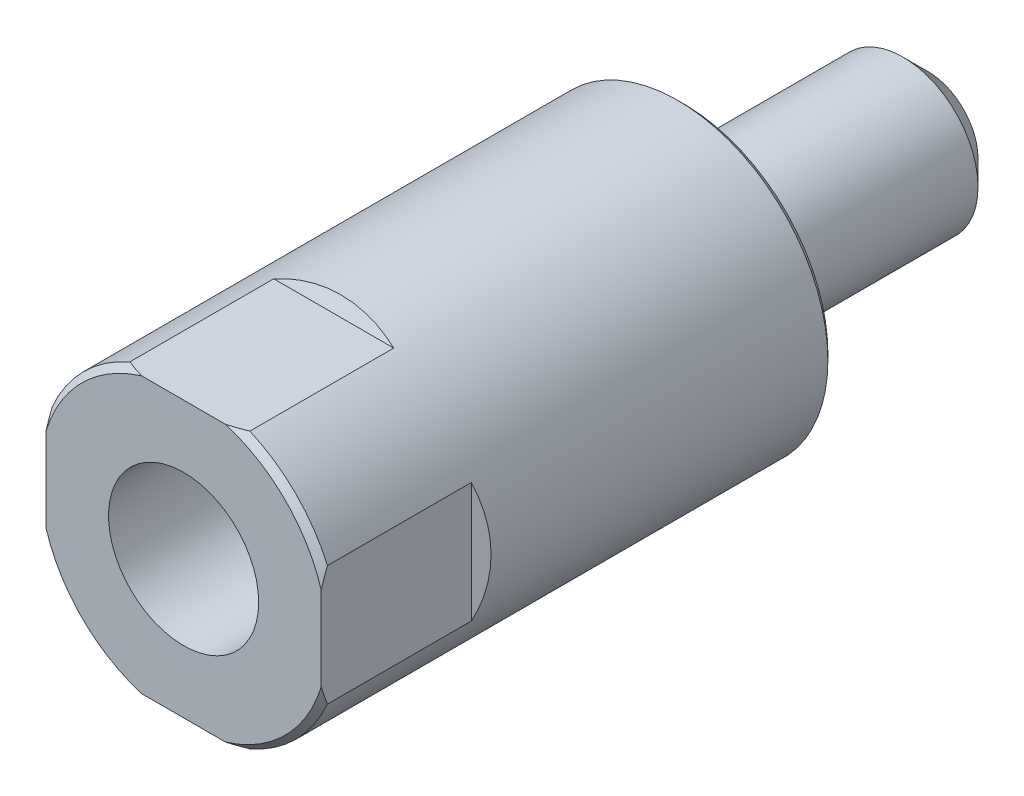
ISO-10303-21;
HEADER;
FILE_DESCRIPTION(('STEP AP214'),'2;1');
FILE_NAME('part.step','',(''),(''),'','','');
FILE_SCHEMA(('AUTOMOTIVE_DESIGN { 1 0 10303 214 1 1 1 1 }'));
ENDSEC;
DATA;
#1=APPLICATION_CONTEXT('core data for automotive mechanical design processes');
#2=APPLICATION_PROTOCOL_DEFINITION('international standard','automotive_design',2000,#1);
#3=PRODUCT_CONTEXT('',#1,'mechanical');
#4=PRODUCT('Part','Part','',(#3));
#5=PRODUCT_RELATED_PRODUCT_CATEGORY('part','',(#4));
#6=PRODUCT_DEFINITION_FORMATION('','',#4);
#7=PRODUCT_DEFINITION_CONTEXT('part definition',#1,'design');
#8=PRODUCT_DEFINITION('design','',#6,#7);
#9=PRODUCT_DEFINITION_SHAPE('','',#8);
#10=(LENGTH_UNIT() NAMED_UNIT(*) SI_UNIT(.MILLI.,.METRE.));
#11=(NAMED_UNIT(*) PLANE_ANGLE_UNIT() SI_UNIT($,.RADIAN.));
#12=(NAMED_UNIT(*) SI_UNIT($,.STERADIAN.) SOLID_ANGLE_UNIT());
#13=UNCERTAINTY_MEASURE_WITH_UNIT(LENGTH_MEASURE(1.E-05),#10,'distance_accuracy_value','');
#14=(GEOMETRIC_REPRESENTATION_CONTEXT(3) GLOBAL_UNCERTAINTY_ASSIGNED_CONTEXT((#13)) GLOBAL_UNIT_ASSIGNED_CONTEXT((#10,
#11,#12)) REPRESENTATION_CONTEXT('',''));
#15=CARTESIAN_POINT('',(0.,0.,0.));
#16=DIRECTION('',(0.,0.,1.));
#17=DIRECTION('',(1.,0.,0.));
#18=AXIS2_PLACEMENT_3D('',#15,#16,#17);
#19=CARTESIAN_POINT('',(0.,0.,-19.5));
#20=DIRECTION('',(0.,0.,1.));
#21=DIRECTION('',(1.,0.,0.));
#22=AXIS2_PLACEMENT_3D('',#19,#20,#21);
#23=PLANE('',#22);
#24=CARTESIAN_POINT('',(0.,0.,-19.5));
#25=DIRECTION('',(0.,0.,1.));
#26=DIRECTION('',(1.,0.,0.));
#27=AXIS2_PLACEMENT_3D('',#24,#25,#26);
#28=CIRCLE('',#27,4.);
#29=CARTESIAN_POINT('',(4.,0.,-19.5));
#30=VERTEX_POINT('',#29);
#31=EDGE_CURVE('E139',#30,#30,#28,.F.);
#32=ORIENTED_EDGE('',*,*,#31,.T.);
#33=EDGE_LOOP('',(#32));
#34=FACE_BOUND('',#33,.T.);
#35=ADVANCED_FACE('F14',(#34),#23,.F.);
#36=CARTESIAN_POINT('',(0.,0.,0.5));
#37=DIRECTION('',(0.,0.,1.));
#38=DIRECTION('',(1.,0.,0.));
#39=AXIS2_PLACEMENT_3D('',#36,#37,#38);
#40=CYLINDRICAL_SURFACE('',#39,6.);
#41=CARTESIAN_POINT('',(0.,0.,-17.5));
#42=DIRECTION('',(0.,0.,1.));
#43=DIRECTION('',(1.,0.,0.));
#44=AXIS2_PLACEMENT_3D('',#41,#42,#43);
#45=CIRCLE('',#44,6.);
#46=CARTESIAN_POINT('',(6.,0.,-17.5));
#47=VERTEX_POINT('',#46);
#48=EDGE_CURVE('E176',#47,#47,#45,.T.);
#49=ORIENTED_EDGE('',*,*,#48,.T.);
#50=EDGE_LOOP('',(#49));
#51=FACE_BOUND('',#50,.T.);
#52=CARTESIAN_POINT('',(0.,1.32706345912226E-13,0.));
#53=DIRECTION('',(0.,0.,1.));
#54=DIRECTION('',(1.,0.,0.));
#55=AXIS2_PLACEMENT_3D('',#52,#53,#54);
#56=CIRCLE('',#55,6.);
#57=CARTESIAN_POINT('',(6.,1.32706345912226E-13,0.));
#58=VERTEX_POINT('',#57);
#59=EDGE_CURVE('E136',#58,#58,#56,.T.);
#60=ORIENTED_EDGE('',*,*,#59,.F.);
#61=EDGE_LOOP('',(#60));
#62=FACE_BOUND('',#61,.T.);
#63=ADVANCED_FACE('F239',(#51,#62),#40,.T.);
#64=CARTESIAN_POINT('',(6.,0.,10.5));
#65=DIRECTION('',(0.,0.,-1.));
#66=DIRECTION('',(-1.,0.,0.));
#67=AXIS2_PLACEMENT_3D('',#64,#65,#66);
#68=PLANE('',#67);
#69=CARTESIAN_POINT('',(0.,0.,10.5));
#70=DIRECTION('',(0.,0.,1.));
#71=DIRECTION('',(1.,0.,0.));
#72=AXIS2_PLACEMENT_3D('',#69,#70,#71);
#73=CIRCLE('',#72,6.);
#74=CARTESIAN_POINT('',(6.,0.,10.5));
#75=VERTEX_POINT('',#74);
#76=EDGE_CURVE('E122',#75,#75,#73,.T.);
#77=ORIENTED_EDGE('',*,*,#76,.T.);
#78=EDGE_LOOP('',(#77));
#79=FACE_BOUND('',#78,.T.);
#80=ADVANCED_FACE('F223',(#79),#68,.F.);
#81=CARTESIAN_POINT('',(11.,-12.,28.));
#82=DIRECTION('',(-0.5,0.,-0.866025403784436));
#83=DIRECTION('',(-0.866025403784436,0.,0.5));
#84=AXIS2_PLACEMENT_3D('',#81,#82,#83);
#85=PLANE('',#84);
#86=CARTESIAN_POINT('',(0.,0.,34.3508529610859));
#87=DIRECTION('',(-0.5,0.,-0.866025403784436));
#88=DIRECTION('',(0.866025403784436,0.,-0.5));
#89=AXIS2_PLACEMENT_3D('',#86,#87,#88);
#90=ELLIPSE('',#89,13.8564064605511,12.);
#91=CARTESIAN_POINT('',(11.,4.7958315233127,28.));
#92=VERTEX_POINT('',#91);
#93=CARTESIAN_POINT('',(11.,-4.79583152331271,28.));
#94=VERTEX_POINT('',#93);
#95=EDGE_CURVE('E159',#92,#94,#90,.T.);
#96=ORIENTED_EDGE('',*,*,#95,.F.);
#97=DIRECTION('',(0.,1.,0.));
#98=VECTOR('',#97,1.);
#99=CARTESIAN_POINT('',(11.,-12.,28.));
#100=LINE('',#99,#98);
#101=EDGE_CURVE('E149',#94,#92,#100,.T.);
#102=ORIENTED_EDGE('',*,*,#101,.F.);
#103=EDGE_LOOP('',(#96,#102));
#104=FACE_BOUND('',#103,.T.);
#105=ADVANCED_FACE('F214',(#104),#85,.F.);
#106=CARTESIAN_POINT('',(11.,-12.,40.));
#107=DIRECTION('',(-1.,0.,0.));
#108=DIRECTION('',(0.,0.,1.));
#109=AXIS2_PLACEMENT_3D('',#106,#107,#108);
#110=PLANE('',#109);
#111=DIRECTION('',(0.,-1.,0.));
#112=VECTOR('',#111,1.);
#113=CARTESIAN_POINT('',(11.,0.,40.));
#114=LINE('',#113,#112);
#115=CARTESIAN_POINT('',(11.,3.35410196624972,40.));
#116=VERTEX_POINT('',#115);
#117=CARTESIAN_POINT('',(11.,-3.3541019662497,40.));
#118=VERTEX_POINT('',#117);
#119=EDGE_CURVE('E156',#116,#118,#114,.T.);
#120=ORIENTED_EDGE('',*,*,#119,.T.);
#121=CARTESIAN_POINT('',(11.,-3.3541019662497,40.));
#122=CARTESIAN_POINT('',(11.,-3.47626806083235,39.9643692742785));
#123=CARTESIAN_POINT('',(11.,-3.59795060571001,39.9270977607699));
#124=CARTESIAN_POINT('',(11.,-3.84025690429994,39.8494888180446));
#125=CARTESIAN_POINT('',(11.,-3.96088123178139,39.8091531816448));
#126=CARTESIAN_POINT('',(11.,-4.2011163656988,39.7255915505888));
#127=CARTESIAN_POINT('',(11.,-4.32072721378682,39.6823656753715));
#128=CARTESIAN_POINT('',(11.,-4.55900582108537,39.5931815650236));
#129=CARTESIAN_POINT('',(11.,-4.67767299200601,39.5472217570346));
#130=CARTESIAN_POINT('',(11.,-4.79583152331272,39.5));
#131=B_SPLINE_CURVE_WITH_KNOTS('',3,(#121,#122,#123,#124,#125,#126,#127,#128,#129,#130),
.UNSPECIFIED.,.F.,.F.,(4,2,2,2,4),(0.,0.381749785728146,0.763277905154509,1.14479026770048,
1.52652428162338),.UNSPECIFIED.);
#132=CARTESIAN_POINT('',(11.,-4.79583152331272,39.5));
#133=VERTEX_POINT('',#132);
#134=EDGE_CURVE('E198',#118,#133,#131,.T.);
#135=ORIENTED_EDGE('',*,*,#134,.T.);
#136=DIRECTION('',(0.,0.,-1.));
#137=VECTOR('',#136,1.);
#138=CARTESIAN_POINT('',(11.,-4.79583152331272,40.));
#139=LINE('',#138,#137);
#140=EDGE_CURVE('E152',#94,#133,#139,.F.);
#141=ORIENTED_EDGE('',*,*,#140,.F.);
#142=ORIENTED_EDGE('',*,*,#101,.T.);
#143=DIRECTION('',(0.,0.,-1.));
#144=VECTOR('',#143,1.);
#145=CARTESIAN_POINT('',(11.,4.79583152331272,40.));
#146=LINE('',#145,#144);
#147=CARTESIAN_POINT('',(11.,4.79583152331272,39.5));
#148=VERTEX_POINT('',#147);
#149=EDGE_CURVE('E154',#148,#92,#146,.T.);
#150=ORIENTED_EDGE('',*,*,#149,.F.);
#151=CARTESIAN_POINT('',(11.,4.79583152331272,39.5));
#152=CARTESIAN_POINT('',(11.,4.67767299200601,39.5472217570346));
#153=CARTESIAN_POINT('',(11.,4.55900582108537,39.5931815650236));
#154=CARTESIAN_POINT('',(11.,4.32072721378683,39.6823656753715));
#155=CARTESIAN_POINT('',(11.,4.20111636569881,39.7255915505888));
#156=CARTESIAN_POINT('',(11.,3.9608812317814,39.8091531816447));
#157=CARTESIAN_POINT('',(11.,3.84025690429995,39.8494888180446));
#158=CARTESIAN_POINT('',(11.,3.59795060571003,39.9270977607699));
#159=CARTESIAN_POINT('',(11.,3.47626806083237,39.9643692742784));
#160=CARTESIAN_POINT('',(11.,3.35410196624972,40.));
#161=B_SPLINE_CURVE_WITH_KNOTS('',3,(#151,#152,#153,#154,#155,#156,#157,#158,#159,#160),
.UNSPECIFIED.,.F.,.F.,(4,2,2,2,4),(0.,0.381734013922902,0.763246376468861,1.14477449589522,
1.52652428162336),.UNSPECIFIED.);
#162=EDGE_CURVE('E191',#148,#116,#161,.T.);
#163=ORIENTED_EDGE('',*,*,#162,.T.);
#164=EDGE_LOOP('',(#120,#135,#141,#142,#150,#163));
#165=FACE_BOUND('',#164,.T.);
#166=ADVANCED_FACE('F208',(#165),#110,.F.);
#167=CARTESIAN_POINT('',(12.,11.,28.));
#168=DIRECTION('',(0.,-0.5,-0.866025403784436));
#169=DIRECTION('',(0.,0.866025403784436,-0.5));
#170=AXIS2_PLACEMENT_3D('',#167,#168,#169);
#171=PLANE('',#170);
#172=CARTESIAN_POINT('',(0.,0.,34.3508529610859));
#173=DIRECTION('',(0.,-0.5,-0.866025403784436));
#174=DIRECTION('',(0.,0.866025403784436,-0.5));
#175=AXIS2_PLACEMENT_3D('',#172,#173,#174);
#176=ELLIPSE('',#175,13.8564064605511,12.);
#177=CARTESIAN_POINT('',(-4.79583152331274,11.,28.));
#178=VERTEX_POINT('',#177);
#179=CARTESIAN_POINT('',(4.79583152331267,11.,28.));
#180=VERTEX_POINT('',#179);
#181=EDGE_CURVE('E168',#178,#180,#176,.T.);
#182=ORIENTED_EDGE('',*,*,#181,.F.);
#183=DIRECTION('',(-1.,0.,0.));
#184=VECTOR('',#183,1.);
#185=CARTESIAN_POINT('',(12.,11.,28.));
#186=LINE('',#185,#184);
#187=EDGE_CURVE('E115',#180,#178,#186,.T.);
#188=ORIENTED_EDGE('',*,*,#187,.F.);
#189=EDGE_LOOP('',(#182,#188));
#190=FACE_BOUND('',#189,.T.);
#191=ADVANCED_FACE('F213',(#190),#171,.F.);
#192=CARTESIAN_POINT('',(12.,11.,40.));
#193=DIRECTION('',(0.,-1.,0.));
#194=DIRECTION('',(1.,0.,0.));
#195=AXIS2_PLACEMENT_3D('',#192,#193,#194);
#196=PLANE('',#195);
#197=DIRECTION('',(0.,0.,-1.));
#198=VECTOR('',#197,1.);
#199=CARTESIAN_POINT('',(-4.79583152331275,11.,40.));
#200=LINE('',#199,#198);
#201=CARTESIAN_POINT('',(-4.79583152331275,11.,39.5));
#202=VERTEX_POINT('',#201);
#203=EDGE_CURVE('E133',#202,#178,#200,.T.);
#204=ORIENTED_EDGE('',*,*,#203,.F.);
#205=CARTESIAN_POINT('',(-4.79583152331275,11.,39.5));
#206=CARTESIAN_POINT('',(-4.67767299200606,11.,39.5472217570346));
#207=CARTESIAN_POINT('',(-4.55900582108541,10.9999999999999,39.5931815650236));
#208=CARTESIAN_POINT('',(-4.32072721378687,10.9999999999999,39.6823656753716));
#209=CARTESIAN_POINT('',(-4.20111636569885,10.9999999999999,39.7255915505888));
#210=CARTESIAN_POINT('',(-3.96088123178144,10.9999999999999,39.8091531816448));
#211=CARTESIAN_POINT('',(-3.84025690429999,10.9999999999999,39.8494888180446));
#212=CARTESIAN_POINT('',(-3.59795060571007,10.9999999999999,39.92709776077));
#213=CARTESIAN_POINT('',(-3.47626806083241,11.,39.9643692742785));
#214=CARTESIAN_POINT('',(-3.35410196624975,11.,40.));
#215=B_SPLINE_CURVE_WITH_KNOTS('',3,(#205,#206,#207,#208,#209,#210,#211,#212,#213,#214),
.UNSPECIFIED.,.F.,.F.,(4,2,2,2,4),(0.,0.381734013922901,0.763246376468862,1.14477449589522,
1.52652428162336),.UNSPECIFIED.);
#216=CARTESIAN_POINT('',(-3.35410196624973,11.,40.));
#217=VERTEX_POINT('',#216);
#218=EDGE_CURVE('E22',#202,#217,#215,.T.);
#219=ORIENTED_EDGE('',*,*,#218,.T.);
#220=DIRECTION('',(1.,0.,0.));
#221=VECTOR('',#220,1.);
#222=CARTESIAN_POINT('',(0.,11.,40.));
#223=LINE('',#222,#221);
#224=CARTESIAN_POINT('',(3.35410196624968,11.,40.));
#225=VERTEX_POINT('',#224);
#226=EDGE_CURVE('E166',#217,#225,#223,.T.);
#227=ORIENTED_EDGE('',*,*,#226,.T.);
#228=CARTESIAN_POINT('',(3.35410196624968,11.,40.));
#229=CARTESIAN_POINT('',(3.47626806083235,11.,39.9643692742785));
#230=CARTESIAN_POINT('',(3.59795060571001,11.,39.92709776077));
#231=CARTESIAN_POINT('',(3.84025690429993,11.,39.8494888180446));
#232=CARTESIAN_POINT('',(3.96088123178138,11.,39.8091531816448));
#233=CARTESIAN_POINT('',(4.20111636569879,11.,39.7255915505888));
#234=CARTESIAN_POINT('',(4.32072721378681,11.,39.6823656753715));
#235=CARTESIAN_POINT('',(4.55900582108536,11.,39.5931815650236));
#236=CARTESIAN_POINT('',(4.677672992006,11.,39.5472217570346));
#237=CARTESIAN_POINT('',(4.7958315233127,11.,39.5));
#238=B_SPLINE_CURVE_WITH_KNOTS('',3,(#228,#229,#230,#231,#232,#233,#234,#235,#236,#237),
.UNSPECIFIED.,.F.,.F.,(4,2,2,2,4),(0.,0.381749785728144,0.763277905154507,1.14479026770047,
1.52652428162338),.UNSPECIFIED.);
#239=CARTESIAN_POINT('',(4.79583152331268,11.,39.5));
#240=VERTEX_POINT('',#239);
#241=EDGE_CURVE('E29',#225,#240,#238,.T.);
#242=ORIENTED_EDGE('',*,*,#241,.T.);
#243=DIRECTION('',(0.,0.,-1.));
#244=VECTOR('',#243,1.);
#245=CARTESIAN_POINT('',(4.79583152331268,11.,40.));
#246=LINE('',#245,#244);
#247=EDGE_CURVE('E131',#180,#240,#246,.F.);
#248=ORIENTED_EDGE('',*,*,#247,.F.);
#249=ORIENTED_EDGE('',*,*,#187,.T.);
#250=EDGE_LOOP('',(#204,#219,#227,#242,#248,#249));
#251=FACE_BOUND('',#250,.T.);
#252=ADVANCED_FACE('F283',(#251),#196,.F.);
#253=CARTESIAN_POINT('',(-11.,-12.,28.));
#254=DIRECTION('',(0.5,0.,-0.866025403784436));
#255=DIRECTION('',(-0.866025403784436,0.,-0.5));
#256=AXIS2_PLACEMENT_3D('',#253,#254,#255);
#257=PLANE('',#256);
#258=CARTESIAN_POINT('',(0.,0.,34.3508529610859));
#259=DIRECTION('',(0.5,0.,-0.866025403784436));
#260=DIRECTION('',(-0.866025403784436,0.,-0.5));
#261=AXIS2_PLACEMENT_3D('',#258,#259,#260);
#262=ELLIPSE('',#261,13.8564064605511,12.);
#263=CARTESIAN_POINT('',(-11.,-4.79583152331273,28.));
#264=VERTEX_POINT('',#263);
#265=CARTESIAN_POINT('',(-11.,4.79583152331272,28.));
#266=VERTEX_POINT('',#265);
#267=EDGE_CURVE('E164',#264,#266,#262,.T.);
#268=ORIENTED_EDGE('',*,*,#267,.F.);
#269=DIRECTION('',(0.,1.,0.));
#270=VECTOR('',#269,1.);
#271=CARTESIAN_POINT('',(-11.,-12.,28.));
#272=LINE('',#271,#270);
#273=EDGE_CURVE('E142',#264,#266,#272,.T.);
#274=ORIENTED_EDGE('',*,*,#273,.T.);
#275=EDGE_LOOP('',(#268,#274));
#276=FACE_BOUND('',#275,.T.);
#277=ADVANCED_FACE('F216',(#276),#257,.F.);
#278=CARTESIAN_POINT('',(-11.,-12.,40.));
#279=DIRECTION('',(1.,0.,0.));
#280=DIRECTION('',(0.,0.,-1.));
#281=AXIS2_PLACEMENT_3D('',#278,#279,#280);
#282=PLANE('',#281);
#283=DIRECTION('',(0.,0.,-1.));
#284=VECTOR('',#283,1.);
#285=CARTESIAN_POINT('',(-11.,-4.79583152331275,40.));
#286=LINE('',#285,#284);
#287=CARTESIAN_POINT('',(-11.,-4.79583152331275,39.5));
#288=VERTEX_POINT('',#287);
#289=EDGE_CURVE('E147',#288,#264,#286,.T.);
#290=ORIENTED_EDGE('',*,*,#289,.F.);
#291=CARTESIAN_POINT('',(-11.,-4.79583152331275,39.5));
#292=CARTESIAN_POINT('',(-11.,-4.67767299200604,39.5472217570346));
#293=CARTESIAN_POINT('',(-11.,-4.55900582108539,39.5931815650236));
#294=CARTESIAN_POINT('',(-11.,-4.32072721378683,39.6823656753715));
#295=CARTESIAN_POINT('',(-11.,-4.20111636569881,39.7255915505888));
#296=CARTESIAN_POINT('',(-11.,-3.96088123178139,39.8091531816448));
#297=CARTESIAN_POINT('',(-11.,-3.84025690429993,39.8494888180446));
#298=CARTESIAN_POINT('',(-11.,-3.59795060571,39.9270977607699));
#299=CARTESIAN_POINT('',(-11.,-3.47626806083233,39.9643692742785));
#300=CARTESIAN_POINT('',(-11.,-3.35410196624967,40.));
#301=B_SPLINE_CURVE_WITH_KNOTS('',3,(#291,#292,#293,#294,#295,#296,#297,#298,#299,#300),
.UNSPECIFIED.,.F.,.F.,(4,2,2,2,4),(0.,0.381734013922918,0.763246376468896,1.14477449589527,
1.52652428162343),.UNSPECIFIED.);
#302=CARTESIAN_POINT('',(-11.,-3.35410196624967,40.));
#303=VERTEX_POINT('',#302);
#304=EDGE_CURVE('E323',#288,#303,#301,.T.);
#305=ORIENTED_EDGE('',*,*,#304,.T.);
#306=DIRECTION('',(0.,1.,0.));
#307=VECTOR('',#306,1.);
#308=CARTESIAN_POINT('',(-11.,0.,40.));
#309=LINE('',#308,#307);
#310=CARTESIAN_POINT('',(-11.,3.3541019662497,40.));
#311=VERTEX_POINT('',#310);
#312=EDGE_CURVE('E161',#303,#311,#309,.T.);
#313=ORIENTED_EDGE('',*,*,#312,.T.);
#314=CARTESIAN_POINT('',(-11.,3.3541019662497,40.));
#315=CARTESIAN_POINT('',(-11.,3.47626806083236,39.9643692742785));
#316=CARTESIAN_POINT('',(-11.,3.59795060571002,39.9270977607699));
#317=CARTESIAN_POINT('',(-11.,3.84025690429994,39.8494888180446));
#318=CARTESIAN_POINT('',(-11.,3.9608812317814,39.8091531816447));
#319=CARTESIAN_POINT('',(-11.,4.20111636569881,39.7255915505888));
#320=CARTESIAN_POINT('',(-11.,4.32072721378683,39.6823656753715));
#321=CARTESIAN_POINT('',(-11.,4.55900582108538,39.5931815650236));
#322=CARTESIAN_POINT('',(-11.,4.67767299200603,39.5472217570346));
#323=CARTESIAN_POINT('',(-11.,4.79583152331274,39.5));
#324=B_SPLINE_CURVE_WITH_KNOTS('',3,(#314,#315,#316,#317,#318,#319,#320,#321,#322,#323),
.UNSPECIFIED.,.F.,.F.,(4,2,2,2,4),(0.,0.381749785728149,0.763277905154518,1.14479026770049,
1.5265242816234),.UNSPECIFIED.);
#325=CARTESIAN_POINT('',(-11.,4.79583152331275,39.5));
#326=VERTEX_POINT('',#325);
#327=EDGE_CURVE('E267',#311,#326,#324,.T.);
#328=ORIENTED_EDGE('',*,*,#327,.T.);
#329=DIRECTION('',(0.,0.,-1.));
#330=VECTOR('',#329,1.);
#331=CARTESIAN_POINT('',(-11.,4.79583152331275,40.));
#332=LINE('',#331,#330);
#333=EDGE_CURVE('E145',#266,#326,#332,.F.);
#334=ORIENTED_EDGE('',*,*,#333,.F.);
#335=ORIENTED_EDGE('',*,*,#273,.F.);
#336=EDGE_LOOP('',(#290,#305,#313,#328,#334,#335));
#337=FACE_BOUND('',#336,.T.);
#338=ADVANCED_FACE('F217',(#337),#282,.F.);
#339=CARTESIAN_POINT('',(12.,-11.,28.));
#340=DIRECTION('',(0.,0.5,-0.866025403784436));
#341=DIRECTION('',(0.,0.866025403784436,0.5));
#342=AXIS2_PLACEMENT_3D('',#339,#340,#341);
#343=PLANE('',#342);
#344=CARTESIAN_POINT('',(0.,0.,34.3508529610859));
#345=DIRECTION('',(0.,0.5,-0.866025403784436));
#346=DIRECTION('',(0.,-0.866025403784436,-0.5));
#347=AXIS2_PLACEMENT_3D('',#344,#345,#346);
#348=ELLIPSE('',#347,13.8564064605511,12.);
#349=CARTESIAN_POINT('',(4.79583152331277,-11.,28.));
#350=VERTEX_POINT('',#349);
#351=CARTESIAN_POINT('',(-4.79583152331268,-11.,28.));
#352=VERTEX_POINT('',#351);
#353=EDGE_CURVE('E108',#350,#352,#348,.T.);
#354=ORIENTED_EDGE('',*,*,#353,.F.);
#355=DIRECTION('',(-1.,0.,0.));
#356=VECTOR('',#355,1.);
#357=CARTESIAN_POINT('',(12.,-11.,28.));
#358=LINE('',#357,#356);
#359=EDGE_CURVE('E121',#350,#352,#358,.T.);
#360=ORIENTED_EDGE('',*,*,#359,.T.);
#361=EDGE_LOOP('',(#354,#360));
#362=FACE_BOUND('',#361,.T.);
#363=ADVANCED_FACE('F120',(#362),#343,.F.);
#364=CARTESIAN_POINT('',(12.,-11.,40.));
#365=DIRECTION('',(0.,1.,0.));
#366=DIRECTION('',(-1.,0.,0.));
#367=AXIS2_PLACEMENT_3D('',#364,#365,#366);
#368=PLANE('',#367);
#369=DIRECTION('',(0.,0.,-1.));
#370=VECTOR('',#369,1.);
#371=CARTESIAN_POINT('',(4.79583152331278,-11.,40.));
#372=LINE('',#371,#370);
#373=CARTESIAN_POINT('',(4.79583152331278,-11.,39.5));
#374=VERTEX_POINT('',#373);
#375=EDGE_CURVE('E103',#374,#350,#372,.T.);
#376=ORIENTED_EDGE('',*,*,#375,.F.);
#377=CARTESIAN_POINT('',(4.79583152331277,-11.,39.5));
#378=CARTESIAN_POINT('',(4.67767299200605,-11.,39.5472217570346));
#379=CARTESIAN_POINT('',(4.5590058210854,-11.,39.5931815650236));
#380=CARTESIAN_POINT('',(4.32072721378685,-11.,39.6823656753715));
#381=CARTESIAN_POINT('',(4.20111636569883,-11.,39.7255915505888));
#382=CARTESIAN_POINT('',(3.96088123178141,-11.,39.8091531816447));
#383=CARTESIAN_POINT('',(3.84025690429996,-11.,39.8494888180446));
#384=CARTESIAN_POINT('',(3.59795060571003,-11.,39.9270977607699));
#385=CARTESIAN_POINT('',(3.47626806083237,-11.,39.9643692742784));
#386=CARTESIAN_POINT('',(3.35410196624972,-11.,40.));
#387=B_SPLINE_CURVE_WITH_KNOTS('',3,(#377,#378,#379,#380,#381,#382,#383,#384,#385,#386),
.UNSPECIFIED.,.F.,.F.,(4,2,2,2,4),(0.,0.381734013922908,0.763246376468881,1.14477449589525,
1.5265242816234),.UNSPECIFIED.);
#388=CARTESIAN_POINT('',(3.35410196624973,-11.,40.));
#389=VERTEX_POINT('',#388);
#390=EDGE_CURVE('E259',#374,#389,#387,.T.);
#391=ORIENTED_EDGE('',*,*,#390,.T.);
#392=DIRECTION('',(-1.,0.,0.));
#393=VECTOR('',#392,1.);
#394=CARTESIAN_POINT('',(0.,-11.,40.));
#395=LINE('',#394,#393);
#396=CARTESIAN_POINT('',(-3.35410196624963,-11.,40.));
#397=VERTEX_POINT('',#396);
#398=EDGE_CURVE('E123',#389,#397,#395,.T.);
#399=ORIENTED_EDGE('',*,*,#398,.T.);
#400=CARTESIAN_POINT('',(-3.35410196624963,-11.,40.));
#401=CARTESIAN_POINT('',(-3.47626806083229,-11.,39.9643692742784));
#402=CARTESIAN_POINT('',(-3.59795060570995,-11.,39.9270977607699));
#403=CARTESIAN_POINT('',(-3.84025690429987,-11.0000000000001,39.8494888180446));
#404=CARTESIAN_POINT('',(-3.96088123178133,-11.0000000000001,39.8091531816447));
#405=CARTESIAN_POINT('',(-4.20111636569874,-11.0000000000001,39.7255915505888));
#406=CARTESIAN_POINT('',(-4.32072721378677,-11.0000000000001,39.6823656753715));
#407=CARTESIAN_POINT('',(-4.55900582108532,-11.0000000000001,39.5931815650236));
#408=CARTESIAN_POINT('',(-4.67767299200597,-11.,39.5472217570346));
#409=CARTESIAN_POINT('',(-4.79583152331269,-11.,39.5));
#410=B_SPLINE_CURVE_WITH_KNOTS('',3,(#400,#401,#402,#403,#404,#405,#406,#407,#408,#409),
.UNSPECIFIED.,.F.,.F.,(4,2,2,2,4),(0.,0.381749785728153,0.763277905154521,1.14479026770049,
1.5265242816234),.UNSPECIFIED.);
#411=CARTESIAN_POINT('',(-4.7958315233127,-11.,39.5));
#412=VERTEX_POINT('',#411);
#413=EDGE_CURVE('E268',#397,#412,#410,.T.);
#414=ORIENTED_EDGE('',*,*,#413,.T.);
#415=DIRECTION('',(0.,0.,-1.));
#416=VECTOR('',#415,1.);
#417=CARTESIAN_POINT('',(-4.7958315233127,-11.,40.));
#418=LINE('',#417,#416);
#419=EDGE_CURVE('E116',#352,#412,#418,.F.);
#420=ORIENTED_EDGE('',*,*,#419,.F.);
#421=ORIENTED_EDGE('',*,*,#359,.F.);
#422=EDGE_LOOP('',(#376,#391,#399,#414,#420,#421));
#423=FACE_BOUND('',#422,.T.);
#424=ADVANCED_FACE('F125',(#423),#368,.F.);
#425=CARTESIAN_POINT('',(0.,0.,40.));
#426=DIRECTION('',(0.,0.,-1.));
#427=DIRECTION('',(-1.,0.,0.));
#428=AXIS2_PLACEMENT_3D('',#425,#426,#427);
#429=CYLINDRICAL_SURFACE('',#428,12.);
#430=CARTESIAN_POINT('',(0.,0.,0.499999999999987));
#431=DIRECTION('',(0.,0.,1.));
#432=DIRECTION('',(1.,0.,0.));
#433=AXIS2_PLACEMENT_3D('',#430,#431,#432);
#434=CIRCLE('',#433,12.);
#435=CARTESIAN_POINT('',(12.,0.,0.499999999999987));
#436=VERTEX_POINT('',#435);
#437=EDGE_CURVE('E343',#436,#436,#434,.T.);
#438=ORIENTED_EDGE('',*,*,#437,.T.);
#439=EDGE_LOOP('',(#438));
#440=FACE_BOUND('',#439,.T.);
#441=ORIENTED_EDGE('',*,*,#140,.T.);
#442=CARTESIAN_POINT('',(0.,0.,39.5));
#443=DIRECTION('',(0.,0.,1.));
#444=DIRECTION('',(1.,0.,0.));
#445=AXIS2_PLACEMENT_3D('',#442,#443,#444);
#446=CIRCLE('',#445,12.);
#447=EDGE_CURVE('E111',#133,#374,#446,.F.);
#448=ORIENTED_EDGE('',*,*,#447,.T.);
#449=ORIENTED_EDGE('',*,*,#375,.T.);
#450=ORIENTED_EDGE('',*,*,#353,.T.);
#451=ORIENTED_EDGE('',*,*,#419,.T.);
#452=CARTESIAN_POINT('',(0.,0.,39.5));
#453=DIRECTION('',(0.,0.,1.));
#454=DIRECTION('',(1.,0.,0.));
#455=AXIS2_PLACEMENT_3D('',#452,#453,#454);
#456=CIRCLE('',#455,12.);
#457=EDGE_CURVE('E337',#412,#288,#456,.F.);
#458=ORIENTED_EDGE('',*,*,#457,.T.);
#459=ORIENTED_EDGE('',*,*,#289,.T.);
#460=ORIENTED_EDGE('',*,*,#267,.T.);
#461=ORIENTED_EDGE('',*,*,#333,.T.);
#462=CARTESIAN_POINT('',(0.,0.,39.5));
#463=DIRECTION('',(0.,0.,1.));
#464=DIRECTION('',(1.,0.,0.));
#465=AXIS2_PLACEMENT_3D('',#462,#463,#464);
#466=CIRCLE('',#465,12.);
#467=EDGE_CURVE('E37',#326,#202,#466,.F.);
#468=ORIENTED_EDGE('',*,*,#467,.T.);
#469=ORIENTED_EDGE('',*,*,#203,.T.);
#470=ORIENTED_EDGE('',*,*,#181,.T.);
#471=ORIENTED_EDGE('',*,*,#247,.T.);
#472=CARTESIAN_POINT('',(0.,0.,39.5));
#473=DIRECTION('',(0.,0.,1.));
#474=DIRECTION('',(1.,0.,0.));
#475=AXIS2_PLACEMENT_3D('',#472,#473,#474);
#476=CIRCLE('',#475,12.);
#477=EDGE_CURVE('E322',#240,#148,#476,.F.);
#478=ORIENTED_EDGE('',*,*,#477,.T.);
#479=ORIENTED_EDGE('',*,*,#149,.T.);
#480=ORIENTED_EDGE('',*,*,#95,.T.);
#481=EDGE_LOOP('',(#441,#448,#449,#450,#451,#458,#459,#460,#461,#468,#469,#470,#471,#478,#479,#480));
#482=FACE_BOUND('',#481,.T.);
#483=ADVANCED_FACE('F106',(#440,#482),#429,.T.);
#484=CARTESIAN_POINT('',(0.,0.,0.));
#485=DIRECTION('',(0.,0.,1.));
#486=DIRECTION('',(1.,0.,0.));
#487=AXIS2_PLACEMENT_3D('',#484,#485,#486);
#488=PLANE('',#487);
#489=CARTESIAN_POINT('',(0.,0.,0.));
#490=DIRECTION('',(0.,0.,1.));
#491=DIRECTION('',(1.,0.,0.));
#492=AXIS2_PLACEMENT_3D('',#489,#490,#491);
#493=CIRCLE('',#492,11.5);
#494=CARTESIAN_POINT('',(11.5,0.,0.));
#495=VERTEX_POINT('',#494);
#496=EDGE_CURVE('E9',#495,#495,#493,.F.);
#497=ORIENTED_EDGE('',*,*,#496,.T.);
#498=EDGE_LOOP('',(#497));
#499=FACE_BOUND('',#498,.T.);
#500=ORIENTED_EDGE('',*,*,#59,.T.);
#501=EDGE_LOOP('',(#500));
#502=FACE_BOUND('',#501,.T.);
#503=ADVANCED_FACE('F225',(#499,#502),#488,.F.);
#504=CARTESIAN_POINT('',(0.,0.,40.));
#505=DIRECTION('',(0.,0.,1.));
#506=DIRECTION('',(1.,0.,0.));
#507=AXIS2_PLACEMENT_3D('',#504,#505,#506);
#508=PLANE('',#507);
#509=ORIENTED_EDGE('',*,*,#398,.F.);
#510=CARTESIAN_POINT('',(0.,0.,40.));
#511=DIRECTION('',(0.,0.,1.));
#512=DIRECTION('',(1.,0.,0.));
#513=AXIS2_PLACEMENT_3D('',#510,#511,#512);
#514=CIRCLE('',#513,11.5);
#515=EDGE_CURVE('E188',#389,#118,#514,.T.);
#516=ORIENTED_EDGE('',*,*,#515,.T.);
#517=ORIENTED_EDGE('',*,*,#119,.F.);
#518=CARTESIAN_POINT('',(0.,0.,40.));
#519=DIRECTION('',(0.,0.,1.));
#520=DIRECTION('',(1.,0.,0.));
#521=AXIS2_PLACEMENT_3D('',#518,#519,#520);
#522=CIRCLE('',#521,11.5);
#523=EDGE_CURVE('E179',#116,#225,#522,.T.);
#524=ORIENTED_EDGE('',*,*,#523,.T.);
#525=ORIENTED_EDGE('',*,*,#226,.F.);
#526=CARTESIAN_POINT('',(0.,0.,40.));
#527=DIRECTION('',(0.,0.,1.));
#528=DIRECTION('',(1.,0.,0.));
#529=AXIS2_PLACEMENT_3D('',#526,#527,#528);
#530=CIRCLE('',#529,11.5);
#531=EDGE_CURVE('E182',#217,#311,#530,.T.);
#532=ORIENTED_EDGE('',*,*,#531,.T.);
#533=ORIENTED_EDGE('',*,*,#312,.F.);
#534=CARTESIAN_POINT('',(0.,0.,40.));
#535=DIRECTION('',(0.,0.,1.));
#536=DIRECTION('',(1.,0.,0.));
#537=AXIS2_PLACEMENT_3D('',#534,#535,#536);
#538=CIRCLE('',#537,11.5);
#539=EDGE_CURVE('E185',#303,#397,#538,.T.);
#540=ORIENTED_EDGE('',*,*,#539,.T.);
#541=EDGE_LOOP('',(#509,#516,#517,#524,#525,#532,#533,#540));
#542=FACE_BOUND('',#541,.T.);
#543=CARTESIAN_POINT('',(0.,1.32706345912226E-13,40.));
#544=DIRECTION('',(0.,0.,1.));
#545=DIRECTION('',(1.,0.,0.));
#546=AXIS2_PLACEMENT_3D('',#543,#544,#545);
#547=CIRCLE('',#546,6.);
#548=CARTESIAN_POINT('',(6.,1.32706345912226E-13,40.));
#549=VERTEX_POINT('',#548);
#550=EDGE_CURVE('E135',#549,#549,#547,.T.);
#551=ORIENTED_EDGE('',*,*,#550,.F.);
#552=EDGE_LOOP('',(#551));
#553=FACE_BOUND('',#552,.T.);
#554=ADVANCED_FACE('F228',(#542,#553),#508,.T.);
#555=CARTESIAN_POINT('',(0.,1.32706345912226E-13,40.));
#556=DIRECTION('',(0.,0.,1.));
#557=DIRECTION('',(1.,0.,0.));
#558=AXIS2_PLACEMENT_3D('',#555,#556,#557);
#559=CYLINDRICAL_SURFACE('',#558,6.);
#560=ORIENTED_EDGE('',*,*,#76,.F.);
#561=EDGE_LOOP('',(#560));
#562=FACE_BOUND('',#561,.T.);
#563=ORIENTED_EDGE('',*,*,#550,.T.);
#564=EDGE_LOOP('',(#563));
#565=FACE_BOUND('',#564,.T.);
#566=ADVANCED_FACE('F232',(#562,#565),#559,.F.);
#567=CARTESIAN_POINT('',(0.,0.,-19.5));
#568=DIRECTION('',(0.,0.,1.));
#569=DIRECTION('',(1.,0.,0.));
#570=AXIS2_PLACEMENT_3D('',#567,#568,#569);
#571=CONICAL_SURFACE('',#570,4.,0.785398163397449);
#572=ORIENTED_EDGE('',*,*,#48,.F.);
#573=EDGE_LOOP('',(#572));
#574=FACE_BOUND('',#573,.T.);
#575=ORIENTED_EDGE('',*,*,#31,.F.);
#576=EDGE_LOOP('',(#575));
#577=FACE_BOUND('',#576,.T.);
#578=ADVANCED_FACE('F241',(#574,#577),#571,.T.);
#579=CARTESIAN_POINT('',(0.,0.,40.));
#580=DIRECTION('',(0.,0.,-1.));
#581=DIRECTION('',(-1.,0.,0.));
#582=AXIS2_PLACEMENT_3D('',#579,#580,#581);
#583=CONICAL_SURFACE('',#582,11.5,0.785398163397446);
#584=ORIENTED_EDGE('',*,*,#390,.F.);
#585=ORIENTED_EDGE('',*,*,#447,.F.);
#586=ORIENTED_EDGE('',*,*,#134,.F.);
#587=ORIENTED_EDGE('',*,*,#515,.F.);
#588=EDGE_LOOP('',(#584,#585,#586,#587));
#589=FACE_BOUND('',#588,.T.);
#590=ADVANCED_FACE('F249',(#589),#583,.T.);
#591=CARTESIAN_POINT('',(0.,0.,40.));
#592=DIRECTION('',(0.,0.,-1.));
#593=DIRECTION('',(-1.,0.,0.));
#594=AXIS2_PLACEMENT_3D('',#591,#592,#593);
#595=CONICAL_SURFACE('',#594,11.5,0.785398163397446);
#596=ORIENTED_EDGE('',*,*,#304,.F.);
#597=ORIENTED_EDGE('',*,*,#457,.F.);
#598=ORIENTED_EDGE('',*,*,#413,.F.);
#599=ORIENTED_EDGE('',*,*,#539,.F.);
#600=EDGE_LOOP('',(#596,#597,#598,#599));
#601=FACE_BOUND('',#600,.T.);
#602=ADVANCED_FACE('F254',(#601),#595,.T.);
#603=CARTESIAN_POINT('',(0.,0.,40.));
#604=DIRECTION('',(0.,0.,-1.));
#605=DIRECTION('',(-1.,0.,0.));
#606=AXIS2_PLACEMENT_3D('',#603,#604,#605);
#607=CONICAL_SURFACE('',#606,11.5,0.785398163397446);
#608=ORIENTED_EDGE('',*,*,#218,.F.);
#609=ORIENTED_EDGE('',*,*,#467,.F.);
#610=ORIENTED_EDGE('',*,*,#327,.F.);
#611=ORIENTED_EDGE('',*,*,#531,.F.);
#612=EDGE_LOOP('',(#608,#609,#610,#611));
#613=FACE_BOUND('',#612,.T.);
#614=ADVANCED_FACE('F299',(#613),#607,.T.);
#615=CARTESIAN_POINT('',(0.,0.,40.));
#616=DIRECTION('',(0.,0.,-1.));
#617=DIRECTION('',(-1.,0.,0.));
#618=AXIS2_PLACEMENT_3D('',#615,#616,#617);
#619=CONICAL_SURFACE('',#618,11.5,0.785398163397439);
#620=ORIENTED_EDGE('',*,*,#162,.F.);
#621=ORIENTED_EDGE('',*,*,#477,.F.);
#622=ORIENTED_EDGE('',*,*,#241,.F.);
#623=ORIENTED_EDGE('',*,*,#523,.F.);
#624=EDGE_LOOP('',(#620,#621,#622,#623));
#625=FACE_BOUND('',#624,.T.);
#626=ADVANCED_FACE('F205',(#625),#619,.T.);
#627=CARTESIAN_POINT('',(0.,0.,0.499999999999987));
#628=DIRECTION('',(0.,0.,1.));
#629=DIRECTION('',(1.,0.,0.));
#630=AXIS2_PLACEMENT_3D('',#627,#628,#629);
#631=CONICAL_SURFACE('',#630,12.,0.78539816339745);
#632=ORIENTED_EDGE('',*,*,#496,.F.);
#633=EDGE_LOOP('',(#632));
#634=FACE_BOUND('',#633,.T.);
#635=ORIENTED_EDGE('',*,*,#437,.F.);
#636=EDGE_LOOP('',(#635));
#637=FACE_BOUND('',#636,.T.);
#638=ADVANCED_FACE('F16',(#634,#637),#631,.T.);
#639=CLOSED_SHELL('',(#35,#63,#80,#105,#166,#191,#252,#277,#338,#363,#424,#483,#503,#554,#566,
#578,#590,#602,#614,#626,#638));
#640=MANIFOLD_SOLID_BREP('B1',#639);
#641=ADVANCED_BREP_SHAPE_REPRESENTATION('',(#18,#640),#14);
#642=SHAPE_DEFINITION_REPRESENTATION(#9,#641);
ENDSEC;
END-ISO-10303-21;
